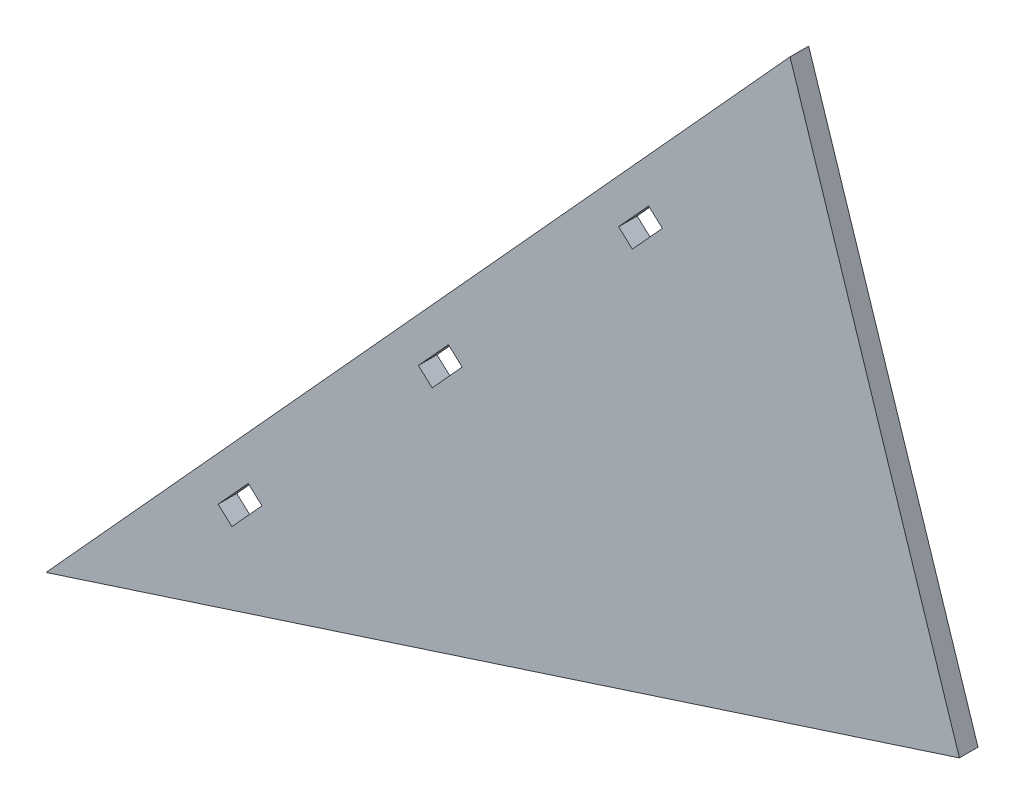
from build123d import *

# Parameters (mm, degrees)
EXTRUDE_1_DEPTH = 2.5


with BuildPart() as part:
    # Sketch 1 → Extrude 1 (new body)
    with BuildSketch(Plane.XY):
        Polygon((98.743782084, 97.254506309), (-1.249135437, -12.751932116), (121.504022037, 27.037385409), align=None)
        Polygon((75.699564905, 65.955739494), (79.735315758, 70.395639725), (81.585274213, 68.714076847), (77.549523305, 64.274176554), align=None, mode=Mode.SUBTRACT)
        Polygon((48.794558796, 36.356404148), (52.830309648, 40.79630438), (54.680268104, 39.114741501), (50.644517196, 34.674841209), align=None, mode=Mode.SUBTRACT)
        Polygon((21.889552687, 6.757068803), (25.925303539, 11.196969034), (27.775261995, 9.515406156), (23.739511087, 5.075505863), align=None, mode=Mode.SUBTRACT)
    extrude(amount=EXTRUDE_1_DEPTH)


solid = part.part
